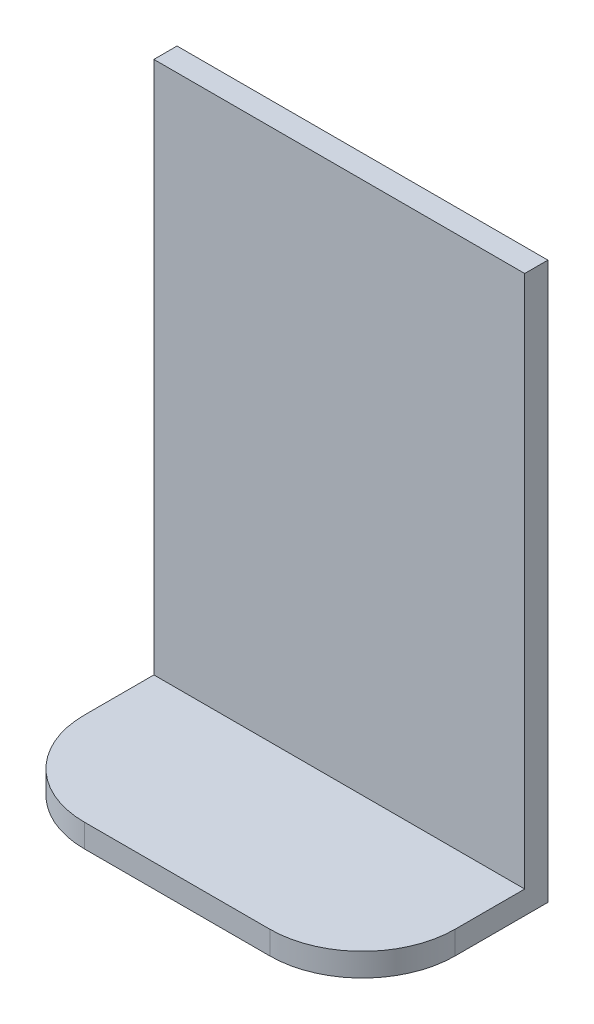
from build123d import *

# Parameters (mm, degrees)
BOSS_EXTRUDE1_DEPTH = 25.4
FILLET1_R           = 12.7


with BuildPart() as part:
    # Sketch1 → Boss-Extrude1 (new, symmetric)
    with BuildSketch(Plane(origin=(0, 0, 0), x_dir=(0, 0, -1), z_dir=(1, 0, 0))):
        Polygon((0, 0), (-25.4, 0), (-25.4, 3.175), (-3.175, 3.175), (-3.175, 76.2), (0, 76.2), align=None)
    extrude(amount=BOSS_EXTRUDE1_DEPTH, both=True)

    # Fillet1
    fillet1_edges = [part.edges().sort_by_distance(p)[0] for p in [
        (25.4, 1.5875, 25.4),
        (-25.4, 1.5875, 25.4),
    ]]
    fillet(fillet1_edges, radius=FILLET1_R)


solid = part.part
